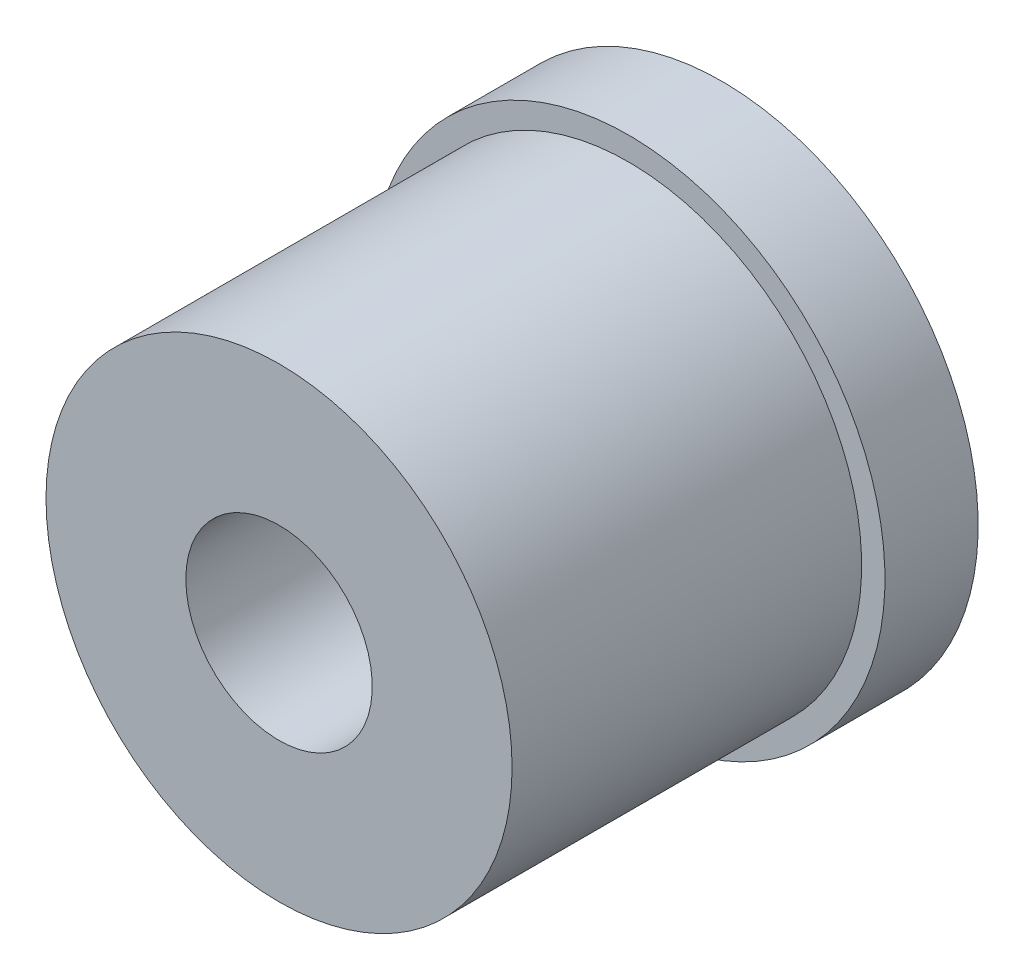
from build123d import *

# Parameters (mm, degrees)
ESQUISSE1_R             = 2.5
EXTRUSION1_DEPTH        = 3.75
ESQUISSE2_R             = 2.75
EXTRUSION2_DEPTH        = 1
ESQUISSE3_R             = 1
ENL_V_MAT_EXTRU_1_DEPTH = 7.139014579


with BuildPart() as part:
    # Esquisse1 → Extrusion1 (new body)
    with BuildSketch(Plane.XY):
        Circle(ESQUISSE1_R)
    extrude(amount=EXTRUSION1_DEPTH)

    # Esquisse2 → Extrusion2 (add)
    with BuildSketch(Plane(origin=(0, 0, 0), x_dir=(-1, 0, 0), z_dir=(0, 0, -1))):
        Circle(ESQUISSE2_R)
    extrude(amount=EXTRUSION2_DEPTH)

    # Esquisse3 → Enl_v. mat.-Extru.1 (cut, through all)
    with BuildSketch(Plane(origin=(0, 0, -1), x_dir=(-1, 0, 0), z_dir=(0, 0, -1))):
        Circle(ESQUISSE3_R)
    extrude(amount=-ENL_V_MAT_EXTRU_1_DEPTH, mode=Mode.SUBTRACT)


solid = part.part
